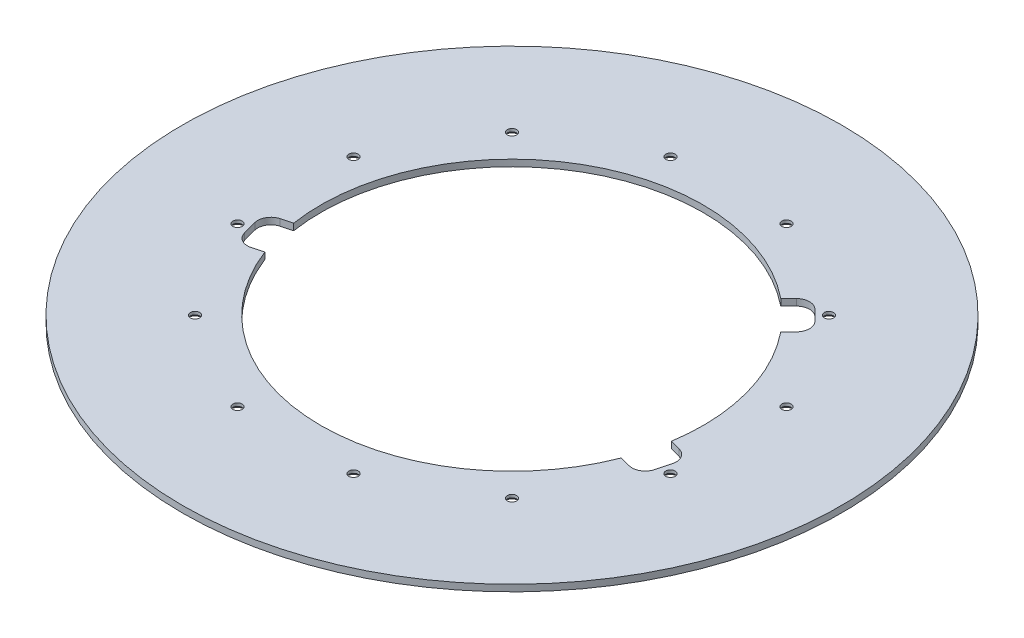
from build123d import *

# Parameters (mm, degrees)
SKETCH1_R           = 158.75
BOSS_EXTRUDE1_DEPTH = 3.175
SKETCH4_R           = 92.075
CUT_EXTRUDE1_DEPTH  = 225.528852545
CIRPATTERN2_COUNT   = 12
CUT_EXTRUDE3_DEPTH  = 225.528852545
CIRPATTERN4_COUNT   = 12


with BuildPart() as part:
    # Sketch1 → Boss-Extrude1 (new body)
    with BuildSketch(Plane(origin=(0, 0, 0), x_dir=(1, 0, 0), z_dir=(0, 1, 0))):
        with Locations(Location((0, 0, 0), (0, 0, 270))):
            Circle(SKETCH1_R)
    extrude(amount=BOSS_EXTRUDE1_DEPTH)

    # Sketch4 → Cut-Extrude1 (cut, through all)
    with BuildSketch(Plane(origin=(0, 3.175, 0), x_dir=(1, 0, 0), z_dir=(0, 1, 0))):
        with Locations(Location((0, 0, 0), (0, 0, 270))):
            Circle(SKETCH4_R)
    extrude(amount=-CUT_EXTRUDE1_DEPTH, mode=Mode.SUBTRACT)

    # Sketch6 → CSK for M4 Flat Head Machine Screw1 (revolve, cut)
    with BuildSketch(Plane(origin=(-27.939515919, 0, -104.271692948), x_dir=(0, 0, -1), z_dir=(1, 0, 0))):
        Polygon((0, 0), (0, 3.175), (2.25, 3.175), (2.25, 1.7505), (4.0005, 0), align=None)
    csk_for_m4_flat_head_machine_screw1 = revolve(axis=Axis((-27.939515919, -6.35, -104.271692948), (0, 1, 0)), mode=Mode.SUBTRACT)

    # CirPattern2: CSK for M4 Flat Head Machine Screw1 ×12 about axis
    cirpattern2_axis = Axis((0, 0, 0), (0, 1, 0))
    for i in range(1, CIRPATTERN2_COUNT):
        add(csk_for_m4_flat_head_machine_screw1.rotate(cirpattern2_axis, i * 360 / CIRPATTERN2_COUNT), mode=Mode.SUBTRACT)

    # Sketch8 → Cut-Extrude3 (cut, through all)
    with BuildSketch(Plane(origin=(0, 3.175, 0), x_dir=(1, 0, 0), z_dir=(0, 1, 0))):
        with BuildLine():
            Line((-98.767545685, -30.080386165), (-100.575396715, -23.333394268))
            ThreePointArc((-100.575396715, -23.333394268), (-99.941029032, -18.514893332), (-96.085268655, -15.556264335))
            Line((-96.085268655, -15.556264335), (-2.547426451, 9.507124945))
            Line((-2.547426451, 9.507124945), (2.547426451, -9.507124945))
            Line((2.547426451, -9.507124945), (-90.990415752, -34.570514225))
            ThreePointArc((-90.990415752, -34.570514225), (-95.808916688, -33.936146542), (-98.767545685, -30.080386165))
        make_face()
    cut_extrude3 = extrude(amount=-CUT_EXTRUDE3_DEPTH, mode=Mode.SUBTRACT)

    # CirPattern4: Cut-Extrude3 ×12 about axis, 9 skipped
    cirpattern4_axis = Axis((0, 3.175, 0), (0, -1, 0))
    add([cut_extrude3.rotate(cirpattern4_axis, i * 360 / CIRPATTERN4_COUNT) for i in range(1, CIRPATTERN4_COUNT) if i not in (1, 2, 3, 4, 6, 8, 9, 10, 11)], mode=Mode.SUBTRACT)


solid = part.part
